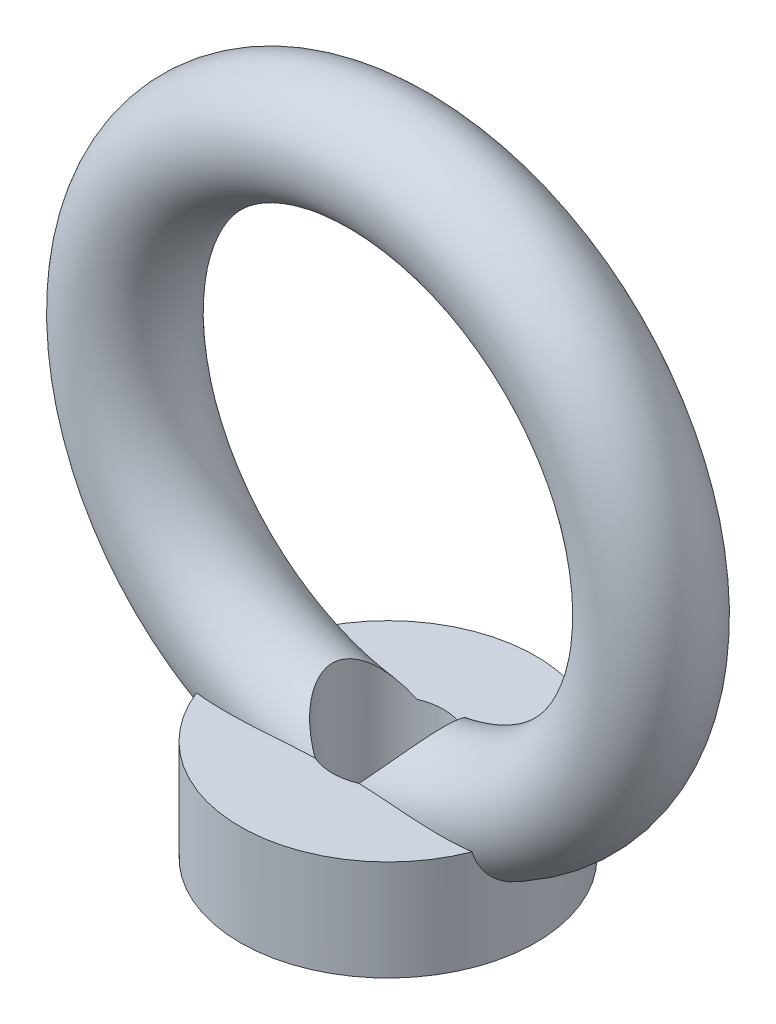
from build123d import *

# Parameters (mm, degrees)
SKETCH1_R          = 25.4
EXTRUDE1_DEPTH     = 17.272
SKETCH2_R          = 9.525
SKETCH3_R          = 9.525
CUT_EXTRUDE1_DEPTH = 25.4


with BuildPart() as part:
    # Sketch1 → Extrude1 (new body)
    with BuildSketch(Plane(origin=(0, 0, 0), x_dir=(1, 0, 0), z_dir=(0, 1, 0))):
        with Locations(Location((0, 0, 0), (0, 0, 270))):
            Circle(SKETCH1_R)
    extrude(amount=EXTRUDE1_DEPTH)

    # Sketch2 → Revolve1 (revolve)
    with BuildSketch(Plane(origin=(0, 0, 0), x_dir=(0, 0, -1), z_dir=(1, 0, 0)), mode=Mode.PRIVATE) as revolve1_sk:
        with Locations((0, 13.348837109)):
            Circle(SKETCH2_R)
    revolve(revolve1_sk.sketch.rotate(Axis((0, 58.560837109, 32.044837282), (0, 0, -1)), 149.91040569), axis=Axis((0, 58.560837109, 32.044837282), (0, 0, -1)))

    # Sketch3 → Cut-Extrude1 (cut)
    with BuildSketch(Plane.XZ):
        with Locations(Location((0, 0, 0), (0, 0, 270))):
            Circle(SKETCH3_R)
    extrude(amount=-CUT_EXTRUDE1_DEPTH, mode=Mode.SUBTRACT)


solid = part.part
